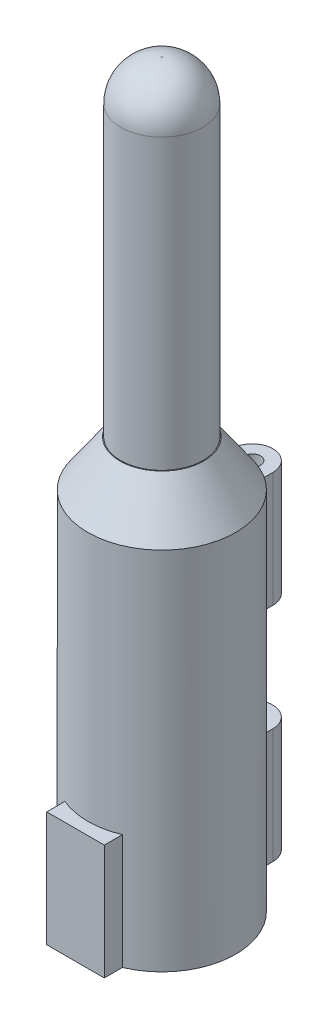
from build123d import *

# Parameters (mm, degrees)
EXTRUSION1_REACH           = 103.396
EXTRUSION1_END_RADIUS      = 9
EXTRUSION1_START           = 10.5
ESQUISSE2_W                = 7
ESQUISSE2_H                = 14
EXTRUSION2_START           = 15
EXTRUSION2_DEPTH           = 14
R_P_TITION_LIN_AIRE1_COUNT = 2
R_P_TITION_LIN_AIRE1_PITCH = 27
ESQUISSE4_R                = 7.5
ENL_V_MAT_EXTRU_1_DEPTH    = 37


with BuildPart() as part:
    # Esquisse1 → R_volution1 (revolve)
    with BuildSketch(Plane(origin=(0, 0, 0), x_dir=(0, 0, -1), z_dir=(1, 0, 0)), mode=Mode.PRIVATE) as r_volution1_sk:
        with BuildLine():
            Line((9, 0), (9, 44.430222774))
            Line((9, 44.430222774), (5.1, 50))
            Line((5.1, 50), (5, 50))
            Line((5, 50), (5, 85.1))
            ThreePointArc((5, 85.1), (3.564823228, 88.564823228), (0.1, 90))
            Line((0.1, 90), (0, 90))
            Line((0, 90), (0, 88.3))
            Line((0, 88.3), (0.1, 88.3))
            ThreePointArc((0.1, 88.3), (2.3627417, 87.3627417), (3.3, 85.1))
            Line((3.3, 85.1), (3.3, 48.3))
            Line((3.3, 48.3), (4.215036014, 48.3))
            Line((4.215036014, 48.3), (7.3, 43.894214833))
            Line((7.3, 43.894214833), (7.3, 0))
            Line((7.3, 0), (9, 0))
        make_face()
    revolve(r_volution1_sk.sketch.rotate(Axis((0, 90, 0), (0, -1, 0)), 180), axis=Axis((0, 90, 0), (0, -1, 0)))

    # Extrusion1: up to this cylinder (the profile starts outside it)
    extrusion1_end = Plane(origin=(0, 7, 0), z_dir=(0, 1, 0)) * Cylinder(EXTRUSION1_END_RADIUS, 225.792, mode=Mode.PRIVATE)
    # Esquisse2 → Extrusion1 (add, up to the surface)
    with BuildSketch(Plane.XY.offset(EXTRUSION1_START), mode=Mode.PRIVATE) as extrusion1_sk1:
        with Locations((0, 7)):
            Rectangle(ESQUISSE2_W, ESQUISSE2_H)
    extrusion1_tool1 = extrude(extrusion1_sk1.sketch, amount=-EXTRUSION1_REACH, mode=Mode.PRIVATE) - extrusion1_end
    add(extrusion1_tool1.solids().sort_by_distance((0, 7, 10.5))[0])

    # Esquisse3 → Extrusion2 (add)
    with BuildSketch(Plane(origin=(0, 0, 0), x_dir=(1, 0, 0), z_dir=(0, 1, 0)).offset(EXTRUSION2_START)):
        with BuildLine():
            ThreePointArc((-2.5, 8.645808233), (-1.262482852, 8.911012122), (0, 9))
            Line((0, 9), (0, 10))
            ThreePointArc((0, 10), (-1, 11), (0, 12))
            Line((0, 12), (0, 13.5))
            ThreePointArc((0, 13.5), (-1.767766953, 12.767766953), (-2.5, 11))
            Line((-2.5, 11), (-2.5, 8.645808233))
        make_face()
        with BuildLine():
            Line((0, 10), (0, 9))
            ThreePointArc((0, 9), (1.262482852, 8.911012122), (2.5, 8.645808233))
            Line((2.5, 8.645808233), (2.5, 11))
            ThreePointArc((2.5, 11), (1.767766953, 12.767766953), (0, 13.5))
            Line((0, 13.5), (0, 12))
            ThreePointArc((0, 12), (0.707106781, 11.707106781), (1, 11))
            ThreePointArc((1, 11), (0.707106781, 10.292893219), (0, 10))
        make_face()
    extrusion2 = extrude(amount=-EXTRUSION2_DEPTH)

    # R_p_tition lin_aire1: Extrusion2 ×2
    with Locations(*[(0, i * R_P_TITION_LIN_AIRE1_PITCH, 0) for i in range(1, R_P_TITION_LIN_AIRE1_COUNT)]):
        add(extrusion2)

    # Esquisse4 → Enl_v. mat.-Extru.1 (cut)
    with BuildSketch(Plane.XZ):
        with Locations(Location((0, 0, 0), (0, 0, 270))):
            Circle(ESQUISSE4_R)
    extrude(amount=-ENL_V_MAT_EXTRU_1_DEPTH, mode=Mode.SUBTRACT)


solid = part.part
